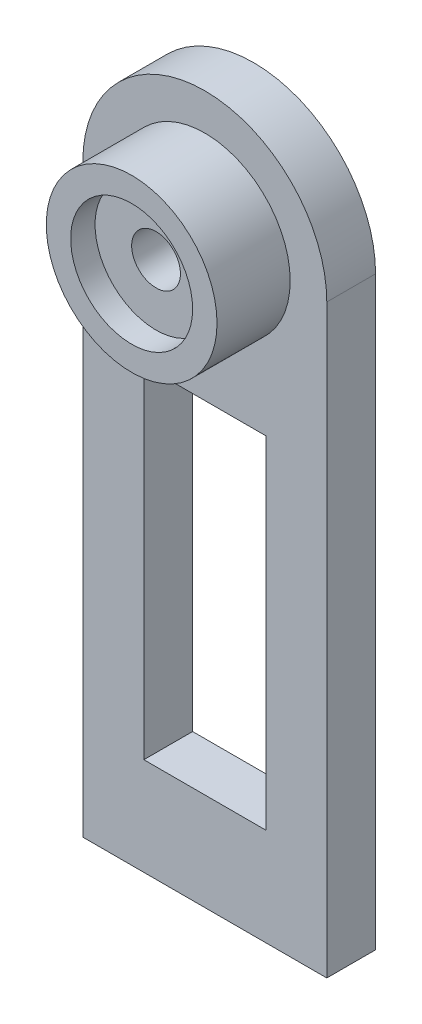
from build123d import *

# Parameters (mm, degrees)
EXTRUDE1_DEPTH                          = 20
SKETCH2_R                               = 35
EXTRUDE2_DEPTH                          = 30
CBORE_FOR_M5_HEX_HEAD_BOLT3_D           = 20
CBORE_FOR_M5_HEX_HEAD_BOLT3_CBORE_D     = 50
CBORE_FOR_M5_HEX_HEAD_BOLT3_CBORE_DEPTH = 10
SKETCH5_W                               = 50
SKETCH5_H                               = 140
CUT_EXTRUDE1_DEPTH                      = 309.220700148


with BuildPart() as part:
    # Sketch1 → Extrude1 (new body)
    with BuildSketch(Plane.XY):
        with BuildLine():
            Line((0, 0), (100, 0))
            Line((100, 0), (100, 240))
            ThreePointArc((100, 240), (50, 290), (0, 240))
            Line((0, 240), (0, 0))
        make_face()
    extrude(amount=-EXTRUDE1_DEPTH)

    # Sketch2 → Extrude2 (add)
    with BuildSketch(Plane.XY):
        with Locations((50, 240)):
            Circle(SKETCH2_R)
    extrude(amount=EXTRUDE2_DEPTH)

    # CBORE for M5 Hex Head Bolt3 (through all)
    with Locations(Plane(origin=(50, 240, 30), x_dir=(1, 0, 0), z_dir=(0, 0, 1))):
        with Locations((0, 0)):
            CounterBoreHole(CBORE_FOR_M5_HEX_HEAD_BOLT3_D / 2, CBORE_FOR_M5_HEX_HEAD_BOLT3_CBORE_D / 2, CBORE_FOR_M5_HEX_HEAD_BOLT3_CBORE_DEPTH)

    # Sketch5 → Cut-Extrude1 (cut, through all)
    with BuildSketch(Plane.XY):
        with Locations((50, 110)):
            Rectangle(SKETCH5_W, SKETCH5_H)
    extrude(amount=-CUT_EXTRUDE1_DEPTH, mode=Mode.SUBTRACT)


solid = part.part
